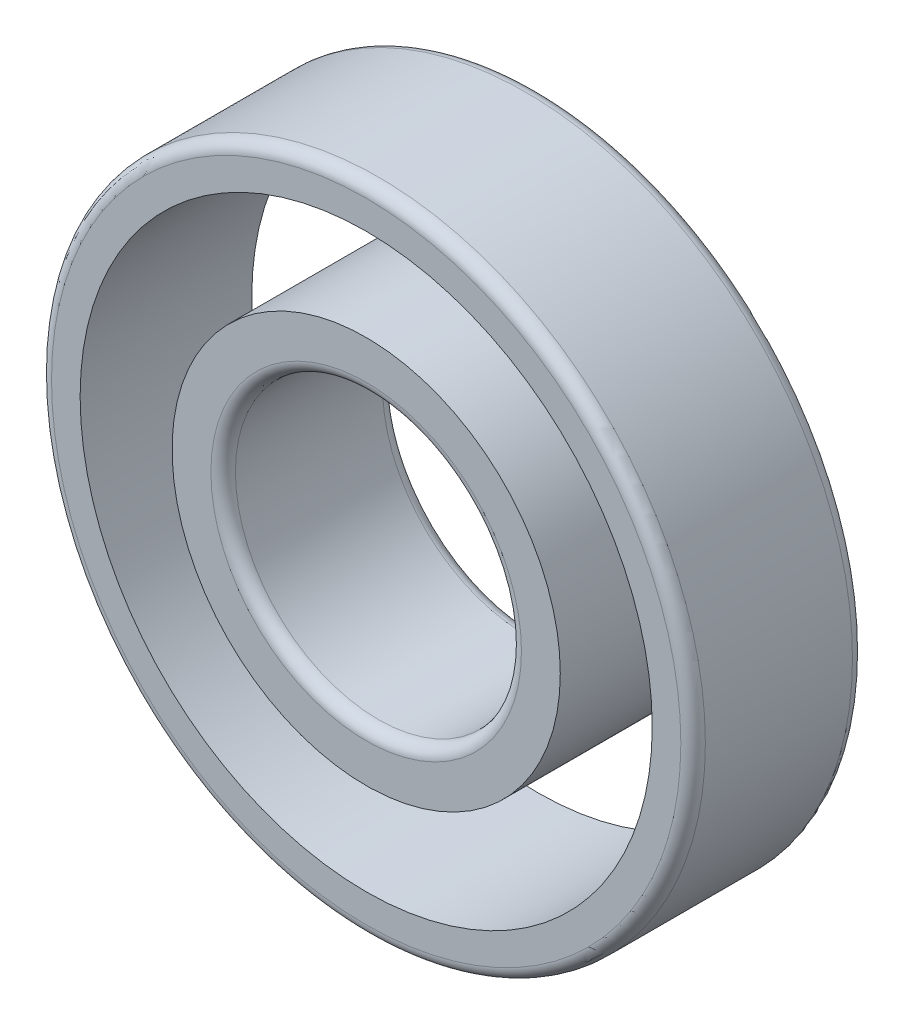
ISO-10303-21;
HEADER;
FILE_DESCRIPTION(('STEP AP214'),'2;1');
FILE_NAME('part.step','',(''),(''),'','','');
FILE_SCHEMA(('AUTOMOTIVE_DESIGN { 1 0 10303 214 1 1 1 1 }'));
ENDSEC;
DATA;
#1=APPLICATION_CONTEXT('core data for automotive mechanical design processes');
#2=APPLICATION_PROTOCOL_DEFINITION('international standard','automotive_design',2000,#1);
#3=PRODUCT_CONTEXT('',#1,'mechanical');
#4=PRODUCT('Part','Part','',(#3));
#5=PRODUCT_RELATED_PRODUCT_CATEGORY('part','',(#4));
#6=PRODUCT_DEFINITION_FORMATION('','',#4);
#7=PRODUCT_DEFINITION_CONTEXT('part definition',#1,'design');
#8=PRODUCT_DEFINITION('design','',#6,#7);
#9=PRODUCT_DEFINITION_SHAPE('','',#8);
#10=(LENGTH_UNIT() NAMED_UNIT(*) SI_UNIT(.MILLI.,.METRE.));
#11=(NAMED_UNIT(*) PLANE_ANGLE_UNIT() SI_UNIT($,.RADIAN.));
#12=(NAMED_UNIT(*) SI_UNIT($,.STERADIAN.) SOLID_ANGLE_UNIT());
#13=UNCERTAINTY_MEASURE_WITH_UNIT(LENGTH_MEASURE(1.E-05),#10,'distance_accuracy_value','');
#14=(GEOMETRIC_REPRESENTATION_CONTEXT(3) GLOBAL_UNCERTAINTY_ASSIGNED_CONTEXT((#13)) GLOBAL_UNIT_ASSIGNED_CONTEXT((#10,
#11,#12)) REPRESENTATION_CONTEXT('',''));
#15=CARTESIAN_POINT('',(0.,0.,0.));
#16=DIRECTION('',(0.,0.,1.));
#17=DIRECTION('',(1.,0.,0.));
#18=AXIS2_PLACEMENT_3D('',#15,#16,#17);
#19=CARTESIAN_POINT('',(0.,0.,0.));
#20=DIRECTION('',(0.,0.,1.));
#21=DIRECTION('',(1.,0.,0.));
#22=AXIS2_PLACEMENT_3D('',#19,#20,#21);
#23=CYLINDRICAL_SURFACE('',#22,35.);
#24=CARTESIAN_POINT('',(0.,0.,-21.));
#25=DIRECTION('',(0.,0.,1.));
#26=DIRECTION('',(1.,0.,0.));
#27=AXIS2_PLACEMENT_3D('',#24,#25,#26);
#28=CIRCLE('',#27,35.);
#29=CARTESIAN_POINT('',(35.,0.,-21.));
#30=VERTEX_POINT('',#29);
#31=EDGE_CURVE('E65',#30,#30,#28,.T.);
#32=ORIENTED_EDGE('',*,*,#31,.F.);
#33=EDGE_LOOP('',(#32));
#34=FACE_BOUND('',#33,.T.);
#35=CARTESIAN_POINT('',(0.,0.,0.));
#36=DIRECTION('',(0.,0.,1.));
#37=DIRECTION('',(1.,0.,0.));
#38=AXIS2_PLACEMENT_3D('',#35,#36,#37);
#39=CIRCLE('',#38,35.);
#40=CARTESIAN_POINT('',(35.,0.,0.));
#41=VERTEX_POINT('',#40);
#42=EDGE_CURVE('E62',#41,#41,#39,.T.);
#43=ORIENTED_EDGE('',*,*,#42,.T.);
#44=EDGE_LOOP('',(#43));
#45=FACE_BOUND('',#44,.T.);
#46=ADVANCED_FACE('F42',(#34,#45),#23,.F.);
#47=CARTESIAN_POINT('',(0.,35.,0.));
#48=DIRECTION('',(0.,0.,-1.));
#49=DIRECTION('',(-1.,0.,0.));
#50=AXIS2_PLACEMENT_3D('',#47,#48,#49);
#51=PLANE('',#50);
#52=CARTESIAN_POINT('',(0.,0.,0.));
#53=DIRECTION('',(0.,0.,-1.));
#54=DIRECTION('',(-1.,0.,0.));
#55=AXIS2_PLACEMENT_3D('',#52,#53,#54);
#56=CIRCLE('',#55,38.5);
#57=CARTESIAN_POINT('',(-38.5,0.,0.));
#58=VERTEX_POINT('',#57);
#59=EDGE_CURVE('E11',#58,#58,#56,.F.);
#60=ORIENTED_EDGE('',*,*,#59,.T.);
#61=EDGE_LOOP('',(#60));
#62=FACE_BOUND('',#61,.T.);
#63=ORIENTED_EDGE('',*,*,#42,.F.);
#64=EDGE_LOOP('',(#63));
#65=FACE_BOUND('',#64,.T.);
#66=ADVANCED_FACE('F73',(#62,#65),#51,.F.);
#67=CARTESIAN_POINT('',(0.,0.,0.));
#68=DIRECTION('',(0.,0.,1.));
#69=DIRECTION('',(1.,0.,0.));
#70=AXIS2_PLACEMENT_3D('',#67,#68,#69);
#71=CYLINDRICAL_SURFACE('',#70,40.);
#72=CARTESIAN_POINT('',(0.,0.,-19.5));
#73=DIRECTION('',(0.,0.,1.));
#74=DIRECTION('',(1.,0.,0.));
#75=AXIS2_PLACEMENT_3D('',#72,#73,#74);
#76=CIRCLE('',#75,40.);
#77=CARTESIAN_POINT('',(40.,0.,-19.5));
#78=VERTEX_POINT('',#77);
#79=EDGE_CURVE('E53',#78,#78,#76,.T.);
#80=ORIENTED_EDGE('',*,*,#79,.T.);
#81=EDGE_LOOP('',(#80));
#82=FACE_BOUND('',#81,.T.);
#83=CARTESIAN_POINT('',(0.,0.,-1.5));
#84=DIRECTION('',(0.,0.,-1.));
#85=DIRECTION('',(-1.,0.,0.));
#86=AXIS2_PLACEMENT_3D('',#83,#84,#85);
#87=CIRCLE('',#86,40.);
#88=CARTESIAN_POINT('',(-40.,0.,-1.5));
#89=VERTEX_POINT('',#88);
#90=EDGE_CURVE('E57',#89,#89,#87,.T.);
#91=ORIENTED_EDGE('',*,*,#90,.T.);
#92=EDGE_LOOP('',(#91));
#93=FACE_BOUND('',#92,.T.);
#94=ADVANCED_FACE('F78',(#82,#93),#71,.T.);
#95=CARTESIAN_POINT('',(0.,40.,-21.));
#96=DIRECTION('',(0.,0.,1.));
#97=DIRECTION('',(1.,0.,0.));
#98=AXIS2_PLACEMENT_3D('',#95,#96,#97);
#99=PLANE('',#98);
#100=CARTESIAN_POINT('',(0.,0.,-21.));
#101=DIRECTION('',(0.,0.,1.));
#102=DIRECTION('',(1.,0.,0.));
#103=AXIS2_PLACEMENT_3D('',#100,#101,#102);
#104=CIRCLE('',#103,38.5);
#105=CARTESIAN_POINT('',(38.5,0.,-21.));
#106=VERTEX_POINT('',#105);
#107=EDGE_CURVE('E49',#106,#106,#104,.F.);
#108=ORIENTED_EDGE('',*,*,#107,.T.);
#109=EDGE_LOOP('',(#108));
#110=FACE_BOUND('',#109,.T.);
#111=ORIENTED_EDGE('',*,*,#31,.T.);
#112=EDGE_LOOP('',(#111));
#113=FACE_BOUND('',#112,.T.);
#114=ADVANCED_FACE('F69',(#110,#113),#99,.F.);
#115=CARTESIAN_POINT('',(0.,0.,-19.5));
#116=DIRECTION('',(0.,0.,1.));
#117=DIRECTION('',(1.,0.,0.));
#118=AXIS2_PLACEMENT_3D('',#115,#116,#117);
#119=TOROIDAL_SURFACE('',#118,38.5,1.5);
#120=ORIENTED_EDGE('',*,*,#107,.F.);
#121=EDGE_LOOP('',(#120));
#122=FACE_BOUND('',#121,.T.);
#123=ORIENTED_EDGE('',*,*,#79,.F.);
#124=EDGE_LOOP('',(#123));
#125=FACE_BOUND('',#124,.T.);
#126=ADVANCED_FACE('F87',(#122,#125),#119,.T.);
#127=CARTESIAN_POINT('',(0.,0.,-1.5));
#128=DIRECTION('',(0.,0.,-1.));
#129=DIRECTION('',(-1.,0.,0.));
#130=AXIS2_PLACEMENT_3D('',#127,#128,#129);
#131=TOROIDAL_SURFACE('',#130,38.5,1.5);
#132=ORIENTED_EDGE('',*,*,#90,.F.);
#133=EDGE_LOOP('',(#132));
#134=FACE_BOUND('',#133,.T.);
#135=ORIENTED_EDGE('',*,*,#59,.F.);
#136=EDGE_LOOP('',(#135));
#137=FACE_BOUND('',#136,.T.);
#138=ADVANCED_FACE('F44',(#134,#137),#131,.T.);
#139=CLOSED_SHELL('',(#46,#66,#94,#114,#126,#138));
#140=MANIFOLD_SOLID_BREP('B2',#139);
#141=CARTESIAN_POINT('',(0.,23.75,0.));
#142=DIRECTION('',(0.,0.,-1.));
#143=DIRECTION('',(-1.,0.,0.));
#144=AXIS2_PLACEMENT_3D('',#141,#142,#143);
#145=PLANE('',#144);
#146=CARTESIAN_POINT('',(0.,0.,0.));
#147=DIRECTION('',(0.,0.,-1.));
#148=DIRECTION('',(-1.,0.,0.));
#149=AXIS2_PLACEMENT_3D('',#146,#147,#148);
#150=CIRCLE('',#149,19.);
#151=CARTESIAN_POINT('',(-19.,0.,0.));
#152=VERTEX_POINT('',#151);
#153=EDGE_CURVE('E41',#152,#152,#150,.T.);
#154=ORIENTED_EDGE('',*,*,#153,.T.);
#155=EDGE_LOOP('',(#154));
#156=FACE_BOUND('',#155,.T.);
#157=CARTESIAN_POINT('',(0.,0.,0.));
#158=DIRECTION('',(0.,0.,1.));
#159=DIRECTION('',(1.,0.,0.));
#160=AXIS2_PLACEMENT_3D('',#157,#158,#159);
#161=CIRCLE('',#160,23.75);
#162=CARTESIAN_POINT('',(23.75,0.,0.));
#163=VERTEX_POINT('',#162);
#164=EDGE_CURVE('E156',#163,#163,#161,.T.);
#165=ORIENTED_EDGE('',*,*,#164,.T.);
#166=EDGE_LOOP('',(#165));
#167=FACE_BOUND('',#166,.T.);
#168=ADVANCED_FACE('F133',(#156,#167),#145,.F.);
#169=CARTESIAN_POINT('',(0.,0.,0.));
#170=DIRECTION('',(0.,0.,1.));
#171=DIRECTION('',(1.,0.,0.));
#172=AXIS2_PLACEMENT_3D('',#169,#170,#171);
#173=CYLINDRICAL_SURFACE('',#172,17.5);
#174=CARTESIAN_POINT('',(0.,0.,-19.5));
#175=DIRECTION('',(0.,0.,1.));
#176=DIRECTION('',(1.,0.,0.));
#177=AXIS2_PLACEMENT_3D('',#174,#175,#176);
#178=CIRCLE('',#177,17.5);
#179=CARTESIAN_POINT('',(17.5,0.,-19.5));
#180=VERTEX_POINT('',#179);
#181=EDGE_CURVE('E140',#180,#180,#178,.F.);
#182=ORIENTED_EDGE('',*,*,#181,.T.);
#183=EDGE_LOOP('',(#182));
#184=FACE_BOUND('',#183,.T.);
#185=CARTESIAN_POINT('',(0.,0.,-1.5));
#186=DIRECTION('',(0.,0.,-1.));
#187=DIRECTION('',(-1.,0.,0.));
#188=AXIS2_PLACEMENT_3D('',#185,#186,#187);
#189=CIRCLE('',#188,17.5);
#190=CARTESIAN_POINT('',(-17.5,0.,-1.5));
#191=VERTEX_POINT('',#190);
#192=EDGE_CURVE('E144',#191,#191,#189,.F.);
#193=ORIENTED_EDGE('',*,*,#192,.T.);
#194=EDGE_LOOP('',(#193));
#195=FACE_BOUND('',#194,.T.);
#196=ADVANCED_FACE('F170',(#184,#195),#173,.F.);
#197=CARTESIAN_POINT('',(0.,17.5,-21.));
#198=DIRECTION('',(0.,0.,1.));
#199=DIRECTION('',(1.,0.,0.));
#200=AXIS2_PLACEMENT_3D('',#197,#198,#199);
#201=PLANE('',#200);
#202=CARTESIAN_POINT('',(0.,0.,-21.));
#203=DIRECTION('',(0.,0.,1.));
#204=DIRECTION('',(1.,0.,0.));
#205=AXIS2_PLACEMENT_3D('',#202,#203,#204);
#206=CIRCLE('',#205,19.);
#207=CARTESIAN_POINT('',(19.,0.,-21.));
#208=VERTEX_POINT('',#207);
#209=EDGE_CURVE('E148',#208,#208,#206,.T.);
#210=ORIENTED_EDGE('',*,*,#209,.T.);
#211=EDGE_LOOP('',(#210));
#212=FACE_BOUND('',#211,.T.);
#213=CARTESIAN_POINT('',(0.,0.,-21.));
#214=DIRECTION('',(0.,0.,1.));
#215=DIRECTION('',(1.,0.,0.));
#216=AXIS2_PLACEMENT_3D('',#213,#214,#215);
#217=CIRCLE('',#216,23.75);
#218=CARTESIAN_POINT('',(23.75,0.,-21.));
#219=VERTEX_POINT('',#218);
#220=EDGE_CURVE('E153',#219,#219,#217,.T.);
#221=ORIENTED_EDGE('',*,*,#220,.F.);
#222=EDGE_LOOP('',(#221));
#223=FACE_BOUND('',#222,.T.);
#224=ADVANCED_FACE('F165',(#212,#223),#201,.F.);
#225=CARTESIAN_POINT('',(0.,0.,0.));
#226=DIRECTION('',(0.,0.,1.));
#227=DIRECTION('',(1.,0.,0.));
#228=AXIS2_PLACEMENT_3D('',#225,#226,#227);
#229=CYLINDRICAL_SURFACE('',#228,23.75);
#230=ORIENTED_EDGE('',*,*,#164,.F.);
#231=EDGE_LOOP('',(#230));
#232=FACE_BOUND('',#231,.T.);
#233=ORIENTED_EDGE('',*,*,#220,.T.);
#234=EDGE_LOOP('',(#233));
#235=FACE_BOUND('',#234,.T.);
#236=ADVANCED_FACE('F161',(#232,#235),#229,.T.);
#237=CARTESIAN_POINT('',(0.,0.,-19.5));
#238=DIRECTION('',(0.,0.,1.));
#239=DIRECTION('',(1.,0.,0.));
#240=AXIS2_PLACEMENT_3D('',#237,#238,#239);
#241=TOROIDAL_SURFACE('',#240,19.,1.5);
#242=ORIENTED_EDGE('',*,*,#181,.F.);
#243=EDGE_LOOP('',(#242));
#244=FACE_BOUND('',#243,.T.);
#245=ORIENTED_EDGE('',*,*,#209,.F.);
#246=EDGE_LOOP('',(#245));
#247=FACE_BOUND('',#246,.T.);
#248=ADVANCED_FACE('F164',(#244,#247),#241,.T.);
#249=CARTESIAN_POINT('',(0.,0.,-1.5));
#250=DIRECTION('',(0.,0.,-1.));
#251=DIRECTION('',(-1.,0.,0.));
#252=AXIS2_PLACEMENT_3D('',#249,#250,#251);
#253=TOROIDAL_SURFACE('',#252,19.,1.5);
#254=ORIENTED_EDGE('',*,*,#153,.F.);
#255=EDGE_LOOP('',(#254));
#256=FACE_BOUND('',#255,.T.);
#257=ORIENTED_EDGE('',*,*,#192,.F.);
#258=EDGE_LOOP('',(#257));
#259=FACE_BOUND('',#258,.T.);
#260=ADVANCED_FACE('F135',(#256,#259),#253,.T.);
#261=CLOSED_SHELL('',(#168,#196,#224,#236,#248,#260));
#262=MANIFOLD_SOLID_BREP('B6',#261);
#263=ADVANCED_BREP_SHAPE_REPRESENTATION('',(#18,#140,#262),#14);
#264=SHAPE_DEFINITION_REPRESENTATION(#9,#263);
ENDSEC;
END-ISO-10303-21;
